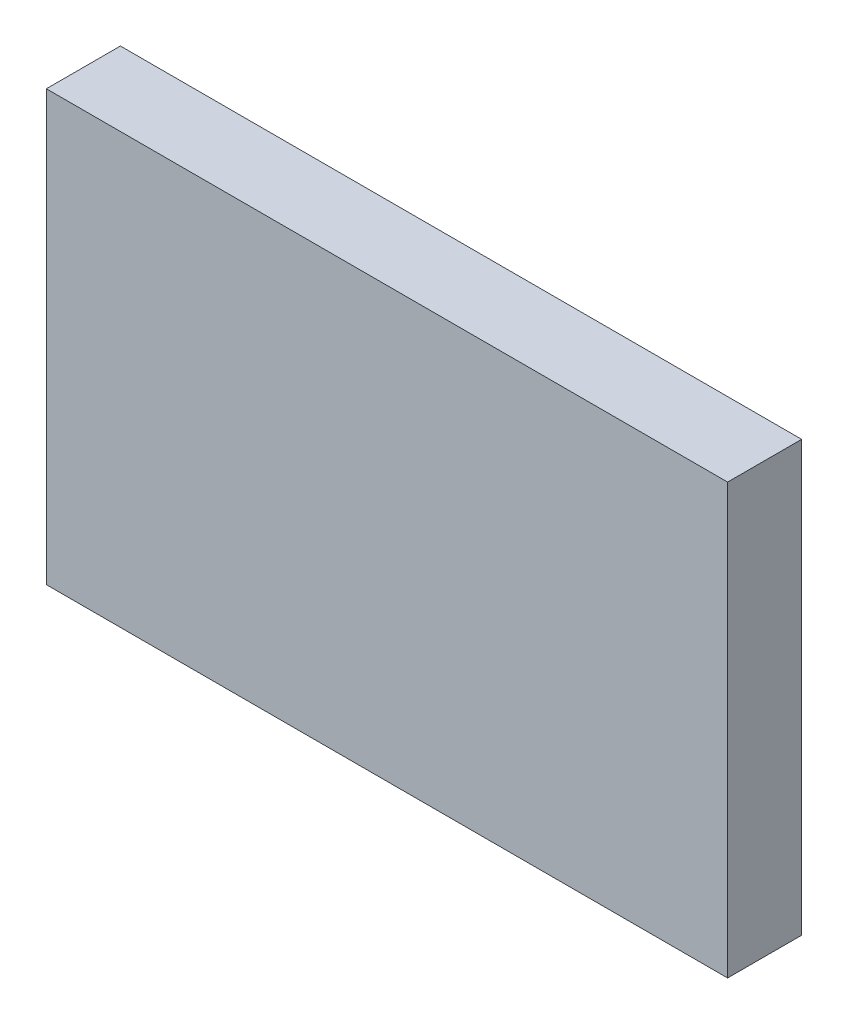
from build123d import *

# Parameters (mm, degrees)
SKETCH1_W           = 230
SKETCH1_H           = 145
BOSS_EXTRUDE1_DEPTH = 19.8
SKETCH1_3_W         = 230
SKETCH1_3_H         = 145
BOSS_EXTRUDE2_DEPTH = 25


with BuildPart() as part:
    # Sketch1 → Boss-Extrude1 (new body)
    with BuildSketch(Plane.XY):
        Rectangle(SKETCH1_W, SKETCH1_H)
    extrude(amount=BOSS_EXTRUDE1_DEPTH)


with BuildPart() as body_2:
    # Sketch1_3 → Boss-Extrude2 (new body)
    with BuildSketch(Plane.XY):
        Rectangle(SKETCH1_3_W, SKETCH1_3_H)
    extrude(amount=BOSS_EXTRUDE2_DEPTH)


solid = Compound([part.part, body_2.part])
